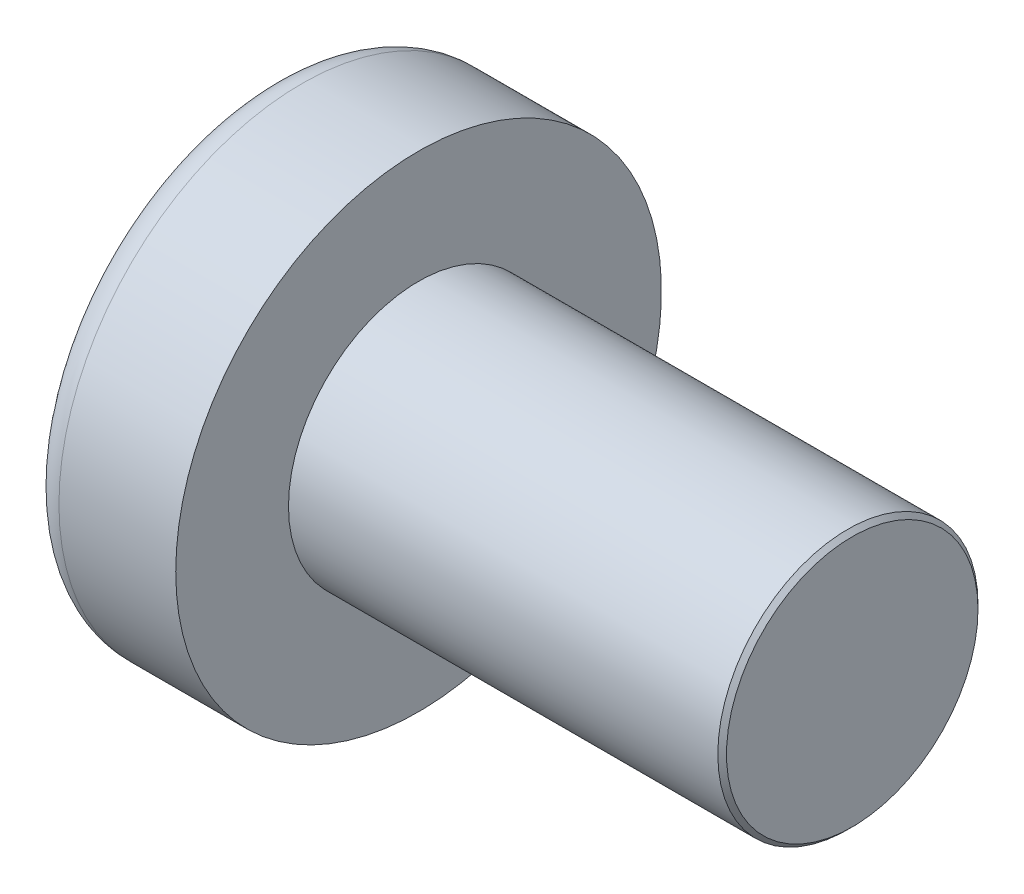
ISO-10303-21;
HEADER;
FILE_DESCRIPTION(('STEP AP214'),'2;1');
FILE_NAME('part.step','',(''),(''),'','','');
FILE_SCHEMA(('AUTOMOTIVE_DESIGN { 1 0 10303 214 1 1 1 1 }'));
ENDSEC;
DATA;
#1=APPLICATION_CONTEXT('core data for automotive mechanical design processes');
#2=APPLICATION_PROTOCOL_DEFINITION('international standard','automotive_design',2000,#1);
#3=PRODUCT_CONTEXT('',#1,'mechanical');
#4=PRODUCT('Part','Part','',(#3));
#5=PRODUCT_RELATED_PRODUCT_CATEGORY('part','',(#4));
#6=PRODUCT_DEFINITION_FORMATION('','',#4);
#7=PRODUCT_DEFINITION_CONTEXT('part definition',#1,'design');
#8=PRODUCT_DEFINITION('design','',#6,#7);
#9=PRODUCT_DEFINITION_SHAPE('','',#8);
#10=(LENGTH_UNIT() NAMED_UNIT(*) SI_UNIT(.MILLI.,.METRE.));
#11=(NAMED_UNIT(*) PLANE_ANGLE_UNIT() SI_UNIT($,.RADIAN.));
#12=(NAMED_UNIT(*) SI_UNIT($,.STERADIAN.) SOLID_ANGLE_UNIT());
#13=UNCERTAINTY_MEASURE_WITH_UNIT(LENGTH_MEASURE(1.E-05),#10,'distance_accuracy_value','');
#14=(GEOMETRIC_REPRESENTATION_CONTEXT(3) GLOBAL_UNCERTAINTY_ASSIGNED_CONTEXT((#13)) GLOBAL_UNIT_ASSIGNED_CONTEXT((#10,
#11,#12)) REPRESENTATION_CONTEXT('',''));
#15=CARTESIAN_POINT('',(0.,0.,0.));
#16=DIRECTION('',(0.,0.,1.));
#17=DIRECTION('',(1.,0.,0.));
#18=AXIS2_PLACEMENT_3D('',#15,#16,#17);
#19=CARTESIAN_POINT('',(5.,0.,0.));
#20=DIRECTION('',(-1.,0.,0.));
#21=DIRECTION('',(0.,1.,0.));
#22=AXIS2_PLACEMENT_3D('',#19,#20,#21);
#23=SPHERICAL_SURFACE('',#22,5.);
#24=CARTESIAN_POINT('',(0.74715070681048,0.,0.));
#25=DIRECTION('',(-1.,0.,0.));
#26=DIRECTION('',(0.,0.,1.));
#27=AXIS2_PLACEMENT_3D('',#24,#25,#26);
#28=CIRCLE('',#27,2.62931034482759);
#29=CARTESIAN_POINT('',(0.74715070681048,0.,2.62931034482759));
#30=VERTEX_POINT('',#29);
#31=EDGE_CURVE('E150',#30,#30,#28,.T.);
#32=ORIENTED_EDGE('',*,*,#31,.T.);
#33=EDGE_LOOP('',(#32));
#34=FACE_BOUND('',#33,.T.);
#35=CARTESIAN_POINT('',(4.98382636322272,-0.153868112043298,0.));
#36=DIRECTION('',(-0.104537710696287,-0.994520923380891,0.));
#37=DIRECTION('',(0.994520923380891,-0.104537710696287,0.));
#38=AXIS2_PLACEMENT_3D('',#35,#36,#37);
#39=CIRCLE('',#38,4.99760572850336);
#40=CARTESIAN_POINT('',(0.188596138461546,0.350175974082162,1.31444652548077));
#41=VERTEX_POINT('',#40);
#42=CARTESIAN_POINT('',(0.0270341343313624,0.367158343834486,0.367158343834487));
#43=VERTEX_POINT('',#42);
#44=EDGE_CURVE('E260',#41,#43,#39,.T.);
#45=ORIENTED_EDGE('',*,*,#44,.F.);
#46=CARTESIAN_POINT('',(3.98403090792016,0.,-1.41352221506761));
#47=DIRECTION('',(0.583636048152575,0.,0.812015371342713));
#48=DIRECTION('',(0.812015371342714,0.,-0.583636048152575));
#49=AXIS2_PLACEMENT_3D('',#46,#47,#48);
#50=CIRCLE('',#49,4.68719124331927);
#51=CARTESIAN_POINT('',(0.188596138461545,-0.350175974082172,1.31444652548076));
#52=VERTEX_POINT('',#51);
#53=EDGE_CURVE('E149',#41,#52,#50,.T.);
#54=ORIENTED_EDGE('',*,*,#53,.T.);
#55=CARTESIAN_POINT('',(4.98382636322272,0.153868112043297,0.));
#56=DIRECTION('',(-0.104537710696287,0.994520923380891,0.));
#57=DIRECTION('',(-0.994520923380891,-0.104537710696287,0.));
#58=AXIS2_PLACEMENT_3D('',#55,#56,#57);
#59=CIRCLE('',#58,4.99760572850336);
#60=CARTESIAN_POINT('',(0.0270341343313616,-0.367158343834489,0.367158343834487));
#61=VERTEX_POINT('',#60);
#62=EDGE_CURVE('E105',#61,#52,#59,.T.);
#63=ORIENTED_EDGE('',*,*,#62,.F.);
#64=CARTESIAN_POINT('',(4.98382636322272,0.,-0.153868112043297));
#65=DIRECTION('',(-0.104537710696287,0.,-0.994520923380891));
#66=DIRECTION('',(-0.994520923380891,0.,0.104537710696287));
#67=AXIS2_PLACEMENT_3D('',#64,#65,#66);
#68=CIRCLE('',#67,4.99760572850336);
#69=CARTESIAN_POINT('',(0.188596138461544,-1.31444652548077,0.350175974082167));
#70=VERTEX_POINT('',#69);
#71=EDGE_CURVE('E130',#70,#61,#68,.T.);
#72=ORIENTED_EDGE('',*,*,#71,.F.);
#73=CARTESIAN_POINT('',(3.98403090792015,1.41352221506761,0.));
#74=DIRECTION('',(0.583636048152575,-0.812015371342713,0.));
#75=DIRECTION('',(0.812015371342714,0.583636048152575,0.));
#76=AXIS2_PLACEMENT_3D('',#73,#74,#75);
#77=CIRCLE('',#76,4.68719124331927);
#78=CARTESIAN_POINT('',(0.188596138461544,-1.31444652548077,-0.350175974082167));
#79=VERTEX_POINT('',#78);
#80=EDGE_CURVE('E138',#70,#79,#77,.T.);
#81=ORIENTED_EDGE('',*,*,#80,.T.);
#82=CARTESIAN_POINT('',(4.98382636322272,0.,0.153868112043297));
#83=DIRECTION('',(-0.104537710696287,0.,0.994520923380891));
#84=DIRECTION('',(0.994520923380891,0.,0.104537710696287));
#85=AXIS2_PLACEMENT_3D('',#82,#83,#84);
#86=CIRCLE('',#85,4.99760572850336);
#87=CARTESIAN_POINT('',(0.0270341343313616,-0.367158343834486,-0.367158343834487));
#88=VERTEX_POINT('',#87);
#89=EDGE_CURVE('E46',#88,#79,#86,.T.);
#90=ORIENTED_EDGE('',*,*,#89,.F.);
#91=CARTESIAN_POINT('',(0.188596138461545,-0.350175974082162,-1.31444652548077));
#92=VERTEX_POINT('',#91);
#93=EDGE_CURVE('E255',#92,#88,#59,.T.);
#94=ORIENTED_EDGE('',*,*,#93,.F.);
#95=CARTESIAN_POINT('',(3.98403090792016,0.,1.41352221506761));
#96=DIRECTION('',(0.583636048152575,0.,-0.812015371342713));
#97=DIRECTION('',(-0.812015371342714,0.,-0.583636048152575));
#98=AXIS2_PLACEMENT_3D('',#95,#96,#97);
#99=CIRCLE('',#98,4.68719124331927);
#100=CARTESIAN_POINT('',(0.188596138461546,0.350175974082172,-1.31444652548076));
#101=VERTEX_POINT('',#100);
#102=EDGE_CURVE('E131',#92,#101,#99,.T.);
#103=ORIENTED_EDGE('',*,*,#102,.T.);
#104=CARTESIAN_POINT('',(0.0270341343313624,0.367158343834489,-0.367158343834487));
#105=VERTEX_POINT('',#104);
#106=EDGE_CURVE('E265',#105,#101,#39,.T.);
#107=ORIENTED_EDGE('',*,*,#106,.F.);
#108=CARTESIAN_POINT('',(0.188596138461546,1.31444652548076,-0.350175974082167));
#109=VERTEX_POINT('',#108);
#110=EDGE_CURVE('E166',#109,#105,#86,.T.);
#111=ORIENTED_EDGE('',*,*,#110,.F.);
#112=CARTESIAN_POINT('',(3.98403090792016,-1.41352221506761,0.));
#113=DIRECTION('',(0.583636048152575,0.812015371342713,0.));
#114=DIRECTION('',(-0.812015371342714,0.583636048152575,0.));
#115=AXIS2_PLACEMENT_3D('',#112,#113,#114);
#116=CIRCLE('',#115,4.68719124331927);
#117=CARTESIAN_POINT('',(0.188596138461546,1.31444652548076,0.350175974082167));
#118=VERTEX_POINT('',#117);
#119=EDGE_CURVE('E54',#109,#118,#116,.T.);
#120=ORIENTED_EDGE('',*,*,#119,.T.);
#121=EDGE_CURVE('E164',#43,#118,#68,.T.);
#122=ORIENTED_EDGE('',*,*,#121,.F.);
#123=EDGE_LOOP('',(#45,#54,#63,#72,#81,#90,#94,#103,#107,#111,#120,#122));
#124=FACE_BOUND('',#123,.T.);
#125=ADVANCED_FACE('F31',(#34,#124),#23,.T.);
#126=CARTESIAN_POINT('',(2.01739130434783,0.,-0.15794466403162));
#127=DIRECTION('',(-0.104537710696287,0.,0.994520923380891));
#128=DIRECTION('',(0.994520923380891,0.,0.104537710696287));
#129=AXIS2_PLACEMENT_3D('',#126,#127,#128);
#130=PLANE('',#129);
#131=ORIENTED_EDGE('',*,*,#110,.T.);
#132=DIRECTION('',(0.989130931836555,-0.103971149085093,0.103971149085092));
#133=VECTOR('',#132,1.);
#134=CARTESIAN_POINT('',(2.03363450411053,0.156237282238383,-0.156237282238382));
#135=LINE('',#134,#133);
#136=CARTESIAN_POINT('',(1.76,0.185000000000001,-0.184999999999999));
#137=VERTEX_POINT('',#136);
#138=EDGE_CURVE('E263',#105,#137,#135,.T.);
#139=ORIENTED_EDGE('',*,*,#138,.T.);
#140=DIRECTION('',(0.80907355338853,-0.581521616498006,0.0850446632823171));
#141=VECTOR('',#140,1.);
#142=CARTESIAN_POINT('',(0.,1.45,-0.37));
#143=LINE('',#142,#141);
#144=EDGE_CURVE('E154',#109,#137,#143,.T.);
#145=ORIENTED_EDGE('',*,*,#144,.F.);
#146=EDGE_LOOP('',(#131,#139,#145));
#147=FACE_BOUND('',#146,.T.);
#148=ADVANCED_FACE('F185',(#147),#130,.T.);
#149=DIRECTION('',(0.80907355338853,0.581521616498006,0.0850446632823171));
#150=VECTOR('',#149,1.);
#151=CARTESIAN_POINT('',(0.,-1.45,-0.37));
#152=LINE('',#151,#150);
#153=CARTESIAN_POINT('',(1.76,-0.185,-0.185));
#154=VERTEX_POINT('',#153);
#155=EDGE_CURVE('E139',#79,#154,#152,.T.);
#156=ORIENTED_EDGE('',*,*,#155,.T.);
#157=DIRECTION('',(-0.989130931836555,-0.103971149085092,-0.103971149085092));
#158=VECTOR('',#157,1.);
#159=CARTESIAN_POINT('',(2.03363450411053,-0.156237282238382,-0.156237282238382));
#160=LINE('',#159,#158);
#161=EDGE_CURVE('E251',#154,#88,#160,.T.);
#162=ORIENTED_EDGE('',*,*,#161,.T.);
#163=ORIENTED_EDGE('',*,*,#89,.T.);
#164=EDGE_LOOP('',(#156,#162,#163));
#165=FACE_BOUND('',#164,.T.);
#166=ADVANCED_FACE('F191',(#165),#130,.T.);
#167=CARTESIAN_POINT('',(2.01739130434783,0.,0.157944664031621));
#168=DIRECTION('',(-0.104537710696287,0.,-0.994520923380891));
#169=DIRECTION('',(-0.994520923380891,0.,0.104537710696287));
#170=AXIS2_PLACEMENT_3D('',#167,#168,#169);
#171=PLANE('',#170);
#172=DIRECTION('',(0.80907355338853,-0.581521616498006,-0.085044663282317));
#173=VECTOR('',#172,1.);
#174=CARTESIAN_POINT('',(0.,1.45,0.37));
#175=LINE('',#174,#173);
#176=CARTESIAN_POINT('',(1.76,0.185,0.185));
#177=VERTEX_POINT('',#176);
#178=EDGE_CURVE('E244',#118,#177,#175,.T.);
#179=ORIENTED_EDGE('',*,*,#178,.T.);
#180=DIRECTION('',(-0.989130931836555,0.103971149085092,0.103971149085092));
#181=VECTOR('',#180,1.);
#182=CARTESIAN_POINT('',(2.03363450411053,0.156237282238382,0.156237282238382));
#183=LINE('',#182,#181);
#184=EDGE_CURVE('E257',#177,#43,#183,.T.);
#185=ORIENTED_EDGE('',*,*,#184,.T.);
#186=ORIENTED_EDGE('',*,*,#121,.T.);
#187=EDGE_LOOP('',(#179,#185,#186));
#188=FACE_BOUND('',#187,.T.);
#189=ADVANCED_FACE('F214',(#188),#171,.T.);
#190=ORIENTED_EDGE('',*,*,#71,.T.);
#191=DIRECTION('',(0.989130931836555,0.103971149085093,-0.103971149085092));
#192=VECTOR('',#191,1.);
#193=CARTESIAN_POINT('',(2.03363450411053,-0.156237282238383,0.156237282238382));
#194=LINE('',#193,#192);
#195=CARTESIAN_POINT('',(1.76,-0.185000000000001,0.184999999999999));
#196=VERTEX_POINT('',#195);
#197=EDGE_CURVE('E103',#61,#196,#194,.T.);
#198=ORIENTED_EDGE('',*,*,#197,.T.);
#199=DIRECTION('',(0.80907355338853,0.581521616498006,-0.0850446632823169));
#200=VECTOR('',#199,1.);
#201=CARTESIAN_POINT('',(0.,-1.45,0.37));
#202=LINE('',#201,#200);
#203=EDGE_CURVE('E128',#70,#196,#202,.T.);
#204=ORIENTED_EDGE('',*,*,#203,.F.);
#205=EDGE_LOOP('',(#190,#198,#204));
#206=FACE_BOUND('',#205,.T.);
#207=ADVANCED_FACE('F127',(#206),#171,.T.);
#208=CARTESIAN_POINT('',(-25.4,0.,0.));
#209=DIRECTION('',(-1.,0.,0.));
#210=DIRECTION('',(0.,0.,1.));
#211=AXIS2_PLACEMENT_3D('',#208,#209,#210);
#212=CYLINDRICAL_SURFACE('',#211,1.5);
#213=CARTESIAN_POINT('',(7.34999999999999,0.,0.));
#214=DIRECTION('',(1.,0.,0.));
#215=DIRECTION('',(0.,0.,-1.));
#216=AXIS2_PLACEMENT_3D('',#213,#214,#215);
#217=CIRCLE('',#216,1.5);
#218=CARTESIAN_POINT('',(7.34999999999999,0.,-1.5));
#219=VERTEX_POINT('',#218);
#220=EDGE_CURVE('E39',#219,#219,#217,.F.);
#221=ORIENTED_EDGE('',*,*,#220,.T.);
#222=EDGE_LOOP('',(#221));
#223=FACE_BOUND('',#222,.T.);
#224=CARTESIAN_POINT('',(2.4,0.,0.));
#225=DIRECTION('',(-1.,0.,0.));
#226=DIRECTION('',(0.,0.,1.));
#227=AXIS2_PLACEMENT_3D('',#224,#225,#226);
#228=CIRCLE('',#227,1.5);
#229=CARTESIAN_POINT('',(2.4,0.,1.5));
#230=VERTEX_POINT('',#229);
#231=EDGE_CURVE('E160',#230,#230,#228,.T.);
#232=ORIENTED_EDGE('',*,*,#231,.F.);
#233=EDGE_LOOP('',(#232));
#234=FACE_BOUND('',#233,.T.);
#235=ADVANCED_FACE('F172',(#223,#234),#212,.T.);
#236=CARTESIAN_POINT('',(2.4,1.5,0.));
#237=DIRECTION('',(-1.,0.,0.));
#238=DIRECTION('',(0.,0.,1.));
#239=AXIS2_PLACEMENT_3D('',#236,#237,#238);
#240=PLANE('',#239);
#241=CARTESIAN_POINT('',(2.4,0.,0.));
#242=DIRECTION('',(-1.,0.,0.));
#243=DIRECTION('',(0.,0.,1.));
#244=AXIS2_PLACEMENT_3D('',#241,#242,#243);
#245=CIRCLE('',#244,2.8);
#246=CARTESIAN_POINT('',(2.4,0.,2.8));
#247=VERTEX_POINT('',#246);
#248=EDGE_CURVE('E157',#247,#247,#245,.T.);
#249=ORIENTED_EDGE('',*,*,#248,.F.);
#250=EDGE_LOOP('',(#249));
#251=FACE_BOUND('',#250,.T.);
#252=ORIENTED_EDGE('',*,*,#231,.T.);
#253=EDGE_LOOP('',(#252));
#254=FACE_BOUND('',#253,.T.);
#255=ADVANCED_FACE('F206',(#251,#254),#240,.F.);
#256=CARTESIAN_POINT('',(-25.4,0.,0.));
#257=DIRECTION('',(-1.,0.,0.));
#258=DIRECTION('',(0.,0.,1.));
#259=AXIS2_PLACEMENT_3D('',#256,#257,#258);
#260=CYLINDRICAL_SURFACE('',#259,2.8);
#261=ORIENTED_EDGE('',*,*,#248,.T.);
#262=EDGE_LOOP('',(#261));
#263=FACE_BOUND('',#262,.T.);
#264=CARTESIAN_POINT('',(1.05335585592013,0.,0.));
#265=DIRECTION('',(-1.,0.,0.));
#266=DIRECTION('',(0.,0.,1.));
#267=AXIS2_PLACEMENT_3D('',#264,#265,#266);
#268=CIRCLE('',#267,2.8);
#269=CARTESIAN_POINT('',(1.05335585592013,0.,2.8));
#270=VERTEX_POINT('',#269);
#271=EDGE_CURVE('E153',#270,#270,#268,.T.);
#272=ORIENTED_EDGE('',*,*,#271,.F.);
#273=EDGE_LOOP('',(#272));
#274=FACE_BOUND('',#273,.T.);
#275=ADVANCED_FACE('F202',(#263,#274),#260,.T.);
#276=CARTESIAN_POINT('',(1.05335585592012,0.,0.));
#277=DIRECTION('',(-1.,0.,0.));
#278=DIRECTION('',(0.,0.,1.));
#279=AXIS2_PLACEMENT_3D('',#276,#277,#278);
#280=TOROIDAL_SURFACE('',#279,2.44,0.36);
#281=ORIENTED_EDGE('',*,*,#271,.T.);
#282=EDGE_LOOP('',(#281));
#283=FACE_BOUND('',#282,.T.);
#284=ORIENTED_EDGE('',*,*,#31,.F.);
#285=EDGE_LOOP('',(#284));
#286=FACE_BOUND('',#285,.T.);
#287=ADVANCED_FACE('F199',(#283,#286),#280,.T.);
#288=CARTESIAN_POINT('',(7.4,1.5,0.));
#289=DIRECTION('',(1.,0.,0.));
#290=DIRECTION('',(0.,0.,-1.));
#291=AXIS2_PLACEMENT_3D('',#288,#289,#290);
#292=PLANE('',#291);
#293=CARTESIAN_POINT('',(7.4,0.,0.));
#294=DIRECTION('',(1.,0.,0.));
#295=DIRECTION('',(0.,0.,-1.));
#296=AXIS2_PLACEMENT_3D('',#293,#294,#295);
#297=CIRCLE('',#296,1.44999999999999);
#298=CARTESIAN_POINT('',(7.4,0.,-1.44999999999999));
#299=VERTEX_POINT('',#298);
#300=EDGE_CURVE('E11',#299,#299,#297,.T.);
#301=ORIENTED_EDGE('',*,*,#300,.T.);
#302=EDGE_LOOP('',(#301));
#303=FACE_BOUND('',#302,.T.);
#304=ADVANCED_FACE('F197',(#303),#292,.T.);
#305=CARTESIAN_POINT('',(1.76,0.185,0.185));
#306=DIRECTION('',(0.583636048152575,0.812015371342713,0.));
#307=DIRECTION('',(-0.812015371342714,0.583636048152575,0.));
#308=AXIS2_PLACEMENT_3D('',#305,#306,#307);
#309=PLANE('',#308);
#310=ORIENTED_EDGE('',*,*,#144,.T.);
#311=DIRECTION('',(0.,0.,-1.));
#312=VECTOR('',#311,1.);
#313=CARTESIAN_POINT('',(1.76,0.185,0.185));
#314=LINE('',#313,#312);
#315=EDGE_CURVE('E121',#177,#137,#314,.T.);
#316=ORIENTED_EDGE('',*,*,#315,.F.);
#317=ORIENTED_EDGE('',*,*,#178,.F.);
#318=ORIENTED_EDGE('',*,*,#119,.F.);
#319=EDGE_LOOP('',(#310,#316,#317,#318));
#320=FACE_BOUND('',#319,.T.);
#321=ADVANCED_FACE('F223',(#320),#309,.F.);
#322=CARTESIAN_POINT('',(1.76,-0.185,-0.185));
#323=DIRECTION('',(0.583636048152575,-0.812015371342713,0.));
#324=DIRECTION('',(0.812015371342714,0.583636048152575,0.));
#325=AXIS2_PLACEMENT_3D('',#322,#323,#324);
#326=PLANE('',#325);
#327=ORIENTED_EDGE('',*,*,#203,.T.);
#328=DIRECTION('',(0.,0.,1.));
#329=VECTOR('',#328,1.);
#330=CARTESIAN_POINT('',(1.76,-0.185,-0.185));
#331=LINE('',#330,#329);
#332=EDGE_CURVE('E120',#154,#196,#331,.T.);
#333=ORIENTED_EDGE('',*,*,#332,.F.);
#334=ORIENTED_EDGE('',*,*,#155,.F.);
#335=ORIENTED_EDGE('',*,*,#80,.F.);
#336=EDGE_LOOP('',(#327,#333,#334,#335));
#337=FACE_BOUND('',#336,.T.);
#338=ADVANCED_FACE('F135',(#337),#326,.F.);
#339=CARTESIAN_POINT('',(1.76,-0.185,-0.185));
#340=DIRECTION('',(1.,0.,0.));
#341=DIRECTION('',(0.,0.,-1.));
#342=AXIS2_PLACEMENT_3D('',#339,#340,#341);
#343=PLANE('',#342);
#344=DIRECTION('',(0.,1.,0.));
#345=VECTOR('',#344,1.);
#346=CARTESIAN_POINT('',(1.76,-0.185,-0.185));
#347=LINE('',#346,#345);
#348=EDGE_CURVE('E143',#154,#137,#347,.T.);
#349=ORIENTED_EDGE('',*,*,#348,.F.);
#350=ORIENTED_EDGE('',*,*,#332,.T.);
#351=DIRECTION('',(0.,-1.,0.));
#352=VECTOR('',#351,1.);
#353=CARTESIAN_POINT('',(1.76,0.185,0.185));
#354=LINE('',#353,#352);
#355=EDGE_CURVE('E112',#177,#196,#354,.T.);
#356=ORIENTED_EDGE('',*,*,#355,.F.);
#357=ORIENTED_EDGE('',*,*,#315,.T.);
#358=EDGE_LOOP('',(#349,#350,#356,#357));
#359=FACE_BOUND('',#358,.T.);
#360=ADVANCED_FACE('F141',(#359),#343,.F.);
#361=CARTESIAN_POINT('',(1.76,0.185000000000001,-0.184999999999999));
#362=DIRECTION('',(0.583636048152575,0.,-0.812015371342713));
#363=DIRECTION('',(0.812015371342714,0.,0.583636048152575));
#364=AXIS2_PLACEMENT_3D('',#361,#362,#363);
#365=PLANE('',#364);
#366=DIRECTION('',(0.80907355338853,0.0850446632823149,0.581521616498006));
#367=VECTOR('',#366,1.);
#368=CARTESIAN_POINT('',(0.,-0.369999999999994,-1.45));
#369=LINE('',#368,#367);
#370=EDGE_CURVE('E270',#92,#154,#369,.T.);
#371=ORIENTED_EDGE('',*,*,#370,.T.);
#372=ORIENTED_EDGE('',*,*,#348,.T.);
#373=DIRECTION('',(0.80907355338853,-0.0850446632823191,0.581521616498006));
#374=VECTOR('',#373,1.);
#375=CARTESIAN_POINT('',(0.,0.370000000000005,-1.45));
#376=LINE('',#375,#374);
#377=EDGE_CURVE('E109',#101,#137,#376,.T.);
#378=ORIENTED_EDGE('',*,*,#377,.F.);
#379=ORIENTED_EDGE('',*,*,#102,.F.);
#380=EDGE_LOOP('',(#371,#372,#378,#379));
#381=FACE_BOUND('',#380,.T.);
#382=ADVANCED_FACE('F225',(#381),#365,.F.);
#383=CARTESIAN_POINT('',(2.01739130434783,-0.157944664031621,0.));
#384=DIRECTION('',(-0.104537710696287,0.994520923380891,0.));
#385=DIRECTION('',(-0.994520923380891,-0.104537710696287,0.));
#386=AXIS2_PLACEMENT_3D('',#383,#384,#385);
#387=PLANE('',#386);
#388=ORIENTED_EDGE('',*,*,#93,.T.);
#389=ORIENTED_EDGE('',*,*,#161,.F.);
#390=ORIENTED_EDGE('',*,*,#370,.F.);
#391=EDGE_LOOP('',(#388,#389,#390));
#392=FACE_BOUND('',#391,.T.);
#393=ADVANCED_FACE('F182',(#392),#387,.T.);
#394=CARTESIAN_POINT('',(2.01739130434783,0.15794466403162,0.));
#395=DIRECTION('',(-0.104537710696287,-0.994520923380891,0.));
#396=DIRECTION('',(0.994520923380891,-0.104537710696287,0.));
#397=AXIS2_PLACEMENT_3D('',#394,#395,#396);
#398=PLANE('',#397);
#399=ORIENTED_EDGE('',*,*,#106,.T.);
#400=ORIENTED_EDGE('',*,*,#377,.T.);
#401=ORIENTED_EDGE('',*,*,#138,.F.);
#402=EDGE_LOOP('',(#399,#400,#401));
#403=FACE_BOUND('',#402,.T.);
#404=ADVANCED_FACE('F234',(#403),#398,.T.);
#405=CARTESIAN_POINT('',(1.76,-0.185000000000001,0.184999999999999));
#406=DIRECTION('',(0.583636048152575,0.,0.812015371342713));
#407=DIRECTION('',(-0.812015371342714,0.,0.583636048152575));
#408=AXIS2_PLACEMENT_3D('',#405,#406,#407);
#409=PLANE('',#408);
#410=DIRECTION('',(0.80907355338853,-0.0850446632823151,-0.581521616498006));
#411=VECTOR('',#410,1.);
#412=CARTESIAN_POINT('',(0.,0.369999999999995,1.45));
#413=LINE('',#412,#411);
#414=EDGE_CURVE('E108',#41,#177,#413,.T.);
#415=ORIENTED_EDGE('',*,*,#414,.T.);
#416=ORIENTED_EDGE('',*,*,#355,.T.);
#417=DIRECTION('',(0.80907355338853,0.085044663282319,-0.581521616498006));
#418=VECTOR('',#417,1.);
#419=CARTESIAN_POINT('',(0.,-0.370000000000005,1.45));
#420=LINE('',#419,#418);
#421=EDGE_CURVE('E99',#52,#196,#420,.T.);
#422=ORIENTED_EDGE('',*,*,#421,.F.);
#423=ORIENTED_EDGE('',*,*,#53,.F.);
#424=EDGE_LOOP('',(#415,#416,#422,#423));
#425=FACE_BOUND('',#424,.T.);
#426=ADVANCED_FACE('F113',(#425),#409,.F.);
#427=ORIENTED_EDGE('',*,*,#44,.T.);
#428=ORIENTED_EDGE('',*,*,#184,.F.);
#429=ORIENTED_EDGE('',*,*,#414,.F.);
#430=EDGE_LOOP('',(#427,#428,#429));
#431=FACE_BOUND('',#430,.T.);
#432=ADVANCED_FACE('F180',(#431),#398,.T.);
#433=ORIENTED_EDGE('',*,*,#62,.T.);
#434=ORIENTED_EDGE('',*,*,#421,.T.);
#435=ORIENTED_EDGE('',*,*,#197,.F.);
#436=EDGE_LOOP('',(#433,#434,#435));
#437=FACE_BOUND('',#436,.T.);
#438=ADVANCED_FACE('F101',(#437),#387,.T.);
#439=CARTESIAN_POINT('',(7.34999999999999,0.,0.));
#440=DIRECTION('',(-1.,0.,0.));
#441=DIRECTION('',(0.,0.,1.));
#442=AXIS2_PLACEMENT_3D('',#439,#440,#441);
#443=CONICAL_SURFACE('',#442,1.5,0.785398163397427);
#444=ORIENTED_EDGE('',*,*,#300,.F.);
#445=EDGE_LOOP('',(#444));
#446=FACE_BOUND('',#445,.T.);
#447=ORIENTED_EDGE('',*,*,#220,.F.);
#448=EDGE_LOOP('',(#447));
#449=FACE_BOUND('',#448,.T.);
#450=ADVANCED_FACE('F33',(#446,#449),#443,.T.);
#451=CLOSED_SHELL('',(#125,#148,#166,#189,#207,#235,#255,#275,#287,#304,#321,#338,#360,#382,
#393,#404,#426,#432,#438,#450));
#452=MANIFOLD_SOLID_BREP('B2',#451);
#453=ADVANCED_BREP_SHAPE_REPRESENTATION('',(#18,#452),#14);
#454=SHAPE_DEFINITION_REPRESENTATION(#9,#453);
ENDSEC;
END-ISO-10303-21;
